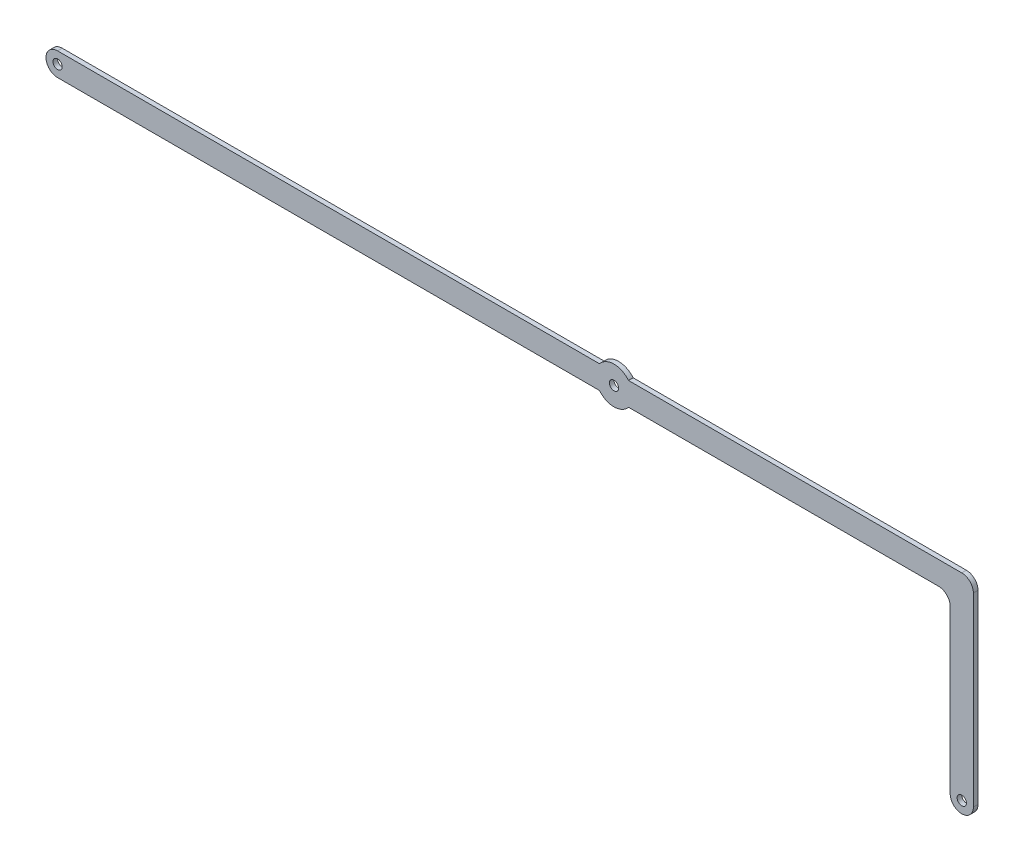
ISO-10303-21;
HEADER;
FILE_DESCRIPTION(('STEP AP214'),'2;1');
FILE_NAME('part.step','',(''),(''),'','','');
FILE_SCHEMA(('AUTOMOTIVE_DESIGN { 1 0 10303 214 1 1 1 1 }'));
ENDSEC;
DATA;
#1=APPLICATION_CONTEXT('core data for automotive mechanical design processes');
#2=APPLICATION_PROTOCOL_DEFINITION('international standard','automotive_design',2000,#1);
#3=PRODUCT_CONTEXT('',#1,'mechanical');
#4=PRODUCT('Part','Part','',(#3));
#5=PRODUCT_RELATED_PRODUCT_CATEGORY('part','',(#4));
#6=PRODUCT_DEFINITION_FORMATION('','',#4);
#7=PRODUCT_DEFINITION_CONTEXT('part definition',#1,'design');
#8=PRODUCT_DEFINITION('design','',#6,#7);
#9=PRODUCT_DEFINITION_SHAPE('','',#8);
#10=(LENGTH_UNIT() NAMED_UNIT(*) SI_UNIT(.MILLI.,.METRE.));
#11=(NAMED_UNIT(*) PLANE_ANGLE_UNIT() SI_UNIT($,.RADIAN.));
#12=(NAMED_UNIT(*) SI_UNIT($,.STERADIAN.) SOLID_ANGLE_UNIT());
#13=UNCERTAINTY_MEASURE_WITH_UNIT(LENGTH_MEASURE(1.E-05),#10,'distance_accuracy_value','');
#14=(GEOMETRIC_REPRESENTATION_CONTEXT(3) GLOBAL_UNCERTAINTY_ASSIGNED_CONTEXT((#13)) GLOBAL_UNIT_ASSIGNED_CONTEXT((#10,
#11,#12)) REPRESENTATION_CONTEXT('',''));
#15=CARTESIAN_POINT('',(0.,0.,0.));
#16=DIRECTION('',(0.,0.,1.));
#17=DIRECTION('',(1.,0.,0.));
#18=AXIS2_PLACEMENT_3D('',#15,#16,#17);
#19=CARTESIAN_POINT('',(120.,0.,1.));
#20=DIRECTION('',(0.,0.,1.));
#21=DIRECTION('',(1.,0.,0.));
#22=AXIS2_PLACEMENT_3D('',#19,#20,#21);
#23=PLANE('',#22);
#24=CARTESIAN_POINT('',(120.,0.,1.));
#25=DIRECTION('',(0.,0.,1.));
#26=DIRECTION('',(1.,0.,0.));
#27=AXIS2_PLACEMENT_3D('',#24,#25,#26);
#28=CIRCLE('',#27,0.999999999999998);
#29=CARTESIAN_POINT('',(121.,0.,1.));
#30=VERTEX_POINT('',#29);
#31=EDGE_CURVE('E300',#30,#30,#28,.T.);
#32=ORIENTED_EDGE('',*,*,#31,.F.);
#33=EDGE_LOOP('',(#32));
#34=FACE_BOUND('',#33,.T.);
#35=CARTESIAN_POINT('',(120.,0.,1.));
#36=DIRECTION('',(0.,0.,1.));
#37=DIRECTION('',(1.,0.,0.));
#38=AXIS2_PLACEMENT_3D('',#35,#36,#37);
#39=CIRCLE('',#38,4.00000000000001);
#40=CARTESIAN_POINT('',(123.122498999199,2.5,1.));
#41=VERTEX_POINT('',#40);
#42=CARTESIAN_POINT('',(116.877501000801,2.5,1.));
#43=VERTEX_POINT('',#42);
#44=EDGE_CURVE('E165',#41,#43,#39,.T.);
#45=ORIENTED_EDGE('',*,*,#44,.T.);
#46=DIRECTION('',(-1.,0.,0.));
#47=VECTOR('',#46,1.);
#48=CARTESIAN_POINT('',(0.,2.5,1.));
#49=LINE('',#48,#47);
#50=CARTESIAN_POINT('',(0.,2.5,1.));
#51=VERTEX_POINT('',#50);
#52=EDGE_CURVE('E134',#43,#51,#49,.T.);
#53=ORIENTED_EDGE('',*,*,#52,.T.);
#54=CARTESIAN_POINT('',(0.,0.,1.));
#55=DIRECTION('',(0.,0.,1.));
#56=DIRECTION('',(1.,0.,0.));
#57=AXIS2_PLACEMENT_3D('',#54,#55,#56);
#58=CIRCLE('',#57,2.5);
#59=CARTESIAN_POINT('',(0.,-2.5,1.));
#60=VERTEX_POINT('',#59);
#61=EDGE_CURVE('E168',#51,#60,#58,.T.);
#62=ORIENTED_EDGE('',*,*,#61,.T.);
#63=DIRECTION('',(1.,0.,0.));
#64=VECTOR('',#63,1.);
#65=CARTESIAN_POINT('',(0.,-2.5,1.));
#66=LINE('',#65,#64);
#67=CARTESIAN_POINT('',(116.877501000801,-2.5,1.));
#68=VERTEX_POINT('',#67);
#69=EDGE_CURVE('E170',#60,#68,#66,.T.);
#70=ORIENTED_EDGE('',*,*,#69,.T.);
#71=CARTESIAN_POINT('',(120.,0.,1.));
#72=DIRECTION('',(0.,0.,1.));
#73=DIRECTION('',(1.,0.,0.));
#74=AXIS2_PLACEMENT_3D('',#71,#72,#73);
#75=CIRCLE('',#74,4.);
#76=CARTESIAN_POINT('',(123.122498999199,-2.5,1.));
#77=VERTEX_POINT('',#76);
#78=EDGE_CURVE('E172',#68,#77,#75,.T.);
#79=ORIENTED_EDGE('',*,*,#78,.T.);
#80=DIRECTION('',(1.,0.,0.));
#81=VECTOR('',#80,1.);
#82=CARTESIAN_POINT('',(123.122498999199,-2.5,1.));
#83=LINE('',#82,#81);
#84=CARTESIAN_POINT('',(190.,-2.5,1.));
#85=VERTEX_POINT('',#84);
#86=EDGE_CURVE('E174',#77,#85,#83,.T.);
#87=ORIENTED_EDGE('',*,*,#86,.T.);
#88=CARTESIAN_POINT('',(190.,-5.,1.));
#89=DIRECTION('',(0.,0.,-1.));
#90=DIRECTION('',(1.,0.,0.));
#91=AXIS2_PLACEMENT_3D('',#88,#89,#90);
#92=CIRCLE('',#91,2.5);
#93=CARTESIAN_POINT('',(192.5,-5.00000000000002,1.));
#94=VERTEX_POINT('',#93);
#95=EDGE_CURVE('E176',#85,#94,#92,.T.);
#96=ORIENTED_EDGE('',*,*,#95,.T.);
#97=DIRECTION('',(0.,-1.,0.));
#98=VECTOR('',#97,1.);
#99=CARTESIAN_POINT('',(192.5,-5.00000000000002,1.));
#100=LINE('',#99,#98);
#101=CARTESIAN_POINT('',(192.5,-40.,1.));
#102=VERTEX_POINT('',#101);
#103=EDGE_CURVE('E178',#94,#102,#100,.T.);
#104=ORIENTED_EDGE('',*,*,#103,.T.);
#105=CARTESIAN_POINT('',(195.,-40.,1.));
#106=DIRECTION('',(0.,0.,1.));
#107=DIRECTION('',(1.,0.,0.));
#108=AXIS2_PLACEMENT_3D('',#105,#106,#107);
#109=CIRCLE('',#108,2.5);
#110=CARTESIAN_POINT('',(197.5,-40.,1.));
#111=VERTEX_POINT('',#110);
#112=EDGE_CURVE('E180',#102,#111,#109,.T.);
#113=ORIENTED_EDGE('',*,*,#112,.T.);
#114=DIRECTION('',(0.,1.,0.));
#115=VECTOR('',#114,1.);
#116=CARTESIAN_POINT('',(197.5,0.,1.));
#117=LINE('',#116,#115);
#118=CARTESIAN_POINT('',(197.5,0.,1.));
#119=VERTEX_POINT('',#118);
#120=EDGE_CURVE('E182',#111,#119,#117,.T.);
#121=ORIENTED_EDGE('',*,*,#120,.T.);
#122=CARTESIAN_POINT('',(195.,0.,1.));
#123=DIRECTION('',(0.,0.,1.));
#124=DIRECTION('',(1.,0.,0.));
#125=AXIS2_PLACEMENT_3D('',#122,#123,#124);
#126=CIRCLE('',#125,2.5);
#127=CARTESIAN_POINT('',(195.,2.5,1.));
#128=VERTEX_POINT('',#127);
#129=EDGE_CURVE('E51',#119,#128,#126,.T.);
#130=ORIENTED_EDGE('',*,*,#129,.T.);
#131=DIRECTION('',(-1.,0.,0.));
#132=VECTOR('',#131,1.);
#133=CARTESIAN_POINT('',(123.122498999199,2.5,1.));
#134=LINE('',#133,#132);
#135=EDGE_CURVE('E46',#128,#41,#134,.T.);
#136=ORIENTED_EDGE('',*,*,#135,.T.);
#137=EDGE_LOOP('',(#45,#53,#62,#70,#79,#87,#96,#104,#113,#121,#130,#136));
#138=FACE_BOUND('',#137,.T.);
#139=CARTESIAN_POINT('',(0.,0.,1.));
#140=DIRECTION('',(0.,0.,1.));
#141=DIRECTION('',(1.,0.,0.));
#142=AXIS2_PLACEMENT_3D('',#139,#140,#141);
#143=CIRCLE('',#142,0.999999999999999);
#144=CARTESIAN_POINT('',(0.999999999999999,0.,1.));
#145=VERTEX_POINT('',#144);
#146=EDGE_CURVE('E139',#145,#145,#143,.T.);
#147=ORIENTED_EDGE('',*,*,#146,.F.);
#148=EDGE_LOOP('',(#147));
#149=FACE_BOUND('',#148,.T.);
#150=CARTESIAN_POINT('',(195.,-40.,1.));
#151=DIRECTION('',(0.,0.,1.));
#152=DIRECTION('',(1.,0.,0.));
#153=AXIS2_PLACEMENT_3D('',#150,#151,#152);
#154=CIRCLE('',#153,0.999999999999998);
#155=CARTESIAN_POINT('',(196.,-40.,1.));
#156=VERTEX_POINT('',#155);
#157=EDGE_CURVE('E289',#156,#156,#154,.T.);
#158=ORIENTED_EDGE('',*,*,#157,.F.);
#159=EDGE_LOOP('',(#158));
#160=FACE_BOUND('',#159,.T.);
#161=ADVANCED_FACE('F31',(#34,#138,#149,#160),#23,.T.);
#162=CARTESIAN_POINT('',(120.,0.,0.));
#163=DIRECTION('',(0.,0.,1.));
#164=DIRECTION('',(1.,0.,0.));
#165=AXIS2_PLACEMENT_3D('',#162,#163,#164);
#166=PLANE('',#165);
#167=CARTESIAN_POINT('',(120.,0.,0.));
#168=DIRECTION('',(0.,0.,1.));
#169=DIRECTION('',(1.,0.,0.));
#170=AXIS2_PLACEMENT_3D('',#167,#168,#169);
#171=CIRCLE('',#170,0.999999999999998);
#172=CARTESIAN_POINT('',(121.,0.,0.));
#173=VERTEX_POINT('',#172);
#174=EDGE_CURVE('E295',#173,#173,#171,.T.);
#175=ORIENTED_EDGE('',*,*,#174,.T.);
#176=EDGE_LOOP('',(#175));
#177=FACE_BOUND('',#176,.T.);
#178=CARTESIAN_POINT('',(120.,0.,0.));
#179=DIRECTION('',(0.,0.,1.));
#180=DIRECTION('',(1.,0.,0.));
#181=AXIS2_PLACEMENT_3D('',#178,#179,#180);
#182=CIRCLE('',#181,4.00000000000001);
#183=CARTESIAN_POINT('',(123.122498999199,2.5,0.));
#184=VERTEX_POINT('',#183);
#185=CARTESIAN_POINT('',(116.877501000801,2.5,0.));
#186=VERTEX_POINT('',#185);
#187=EDGE_CURVE('E125',#184,#186,#182,.T.);
#188=ORIENTED_EDGE('',*,*,#187,.F.);
#189=DIRECTION('',(-1.,0.,0.));
#190=VECTOR('',#189,1.);
#191=CARTESIAN_POINT('',(123.122498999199,2.5,0.));
#192=LINE('',#191,#190);
#193=CARTESIAN_POINT('',(195.,2.5,0.));
#194=VERTEX_POINT('',#193);
#195=EDGE_CURVE('E163',#194,#184,#192,.T.);
#196=ORIENTED_EDGE('',*,*,#195,.F.);
#197=CARTESIAN_POINT('',(195.,0.,0.));
#198=DIRECTION('',(0.,0.,1.));
#199=DIRECTION('',(1.,0.,0.));
#200=AXIS2_PLACEMENT_3D('',#197,#198,#199);
#201=CIRCLE('',#200,2.5);
#202=CARTESIAN_POINT('',(197.5,0.,0.));
#203=VERTEX_POINT('',#202);
#204=EDGE_CURVE('E161',#203,#194,#201,.T.);
#205=ORIENTED_EDGE('',*,*,#204,.F.);
#206=DIRECTION('',(0.,1.,0.));
#207=VECTOR('',#206,1.);
#208=CARTESIAN_POINT('',(197.5,0.,0.));
#209=LINE('',#208,#207);
#210=CARTESIAN_POINT('',(197.5,-40.,0.));
#211=VERTEX_POINT('',#210);
#212=EDGE_CURVE('E159',#211,#203,#209,.T.);
#213=ORIENTED_EDGE('',*,*,#212,.F.);
#214=CARTESIAN_POINT('',(195.,-40.,0.));
#215=DIRECTION('',(0.,0.,1.));
#216=DIRECTION('',(1.,0.,0.));
#217=AXIS2_PLACEMENT_3D('',#214,#215,#216);
#218=CIRCLE('',#217,2.5);
#219=CARTESIAN_POINT('',(192.5,-40.,0.));
#220=VERTEX_POINT('',#219);
#221=EDGE_CURVE('E157',#220,#211,#218,.T.);
#222=ORIENTED_EDGE('',*,*,#221,.F.);
#223=DIRECTION('',(0.,-1.,0.));
#224=VECTOR('',#223,1.);
#225=CARTESIAN_POINT('',(192.5,-5.00000000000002,0.));
#226=LINE('',#225,#224);
#227=CARTESIAN_POINT('',(192.5,-5.00000000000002,0.));
#228=VERTEX_POINT('',#227);
#229=EDGE_CURVE('E155',#228,#220,#226,.T.);
#230=ORIENTED_EDGE('',*,*,#229,.F.);
#231=CARTESIAN_POINT('',(190.,-5.,0.));
#232=DIRECTION('',(0.,0.,-1.));
#233=DIRECTION('',(1.,0.,0.));
#234=AXIS2_PLACEMENT_3D('',#231,#232,#233);
#235=CIRCLE('',#234,2.5);
#236=CARTESIAN_POINT('',(190.,-2.5,0.));
#237=VERTEX_POINT('',#236);
#238=EDGE_CURVE('E153',#237,#228,#235,.T.);
#239=ORIENTED_EDGE('',*,*,#238,.F.);
#240=DIRECTION('',(1.,0.,0.));
#241=VECTOR('',#240,1.);
#242=CARTESIAN_POINT('',(123.122498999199,-2.5,0.));
#243=LINE('',#242,#241);
#244=CARTESIAN_POINT('',(123.122498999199,-2.5,0.));
#245=VERTEX_POINT('',#244);
#246=EDGE_CURVE('E151',#245,#237,#243,.T.);
#247=ORIENTED_EDGE('',*,*,#246,.F.);
#248=CARTESIAN_POINT('',(120.,0.,0.));
#249=DIRECTION('',(0.,0.,1.));
#250=DIRECTION('',(1.,0.,0.));
#251=AXIS2_PLACEMENT_3D('',#248,#249,#250);
#252=CIRCLE('',#251,4.);
#253=CARTESIAN_POINT('',(116.877501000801,-2.5,0.));
#254=VERTEX_POINT('',#253);
#255=EDGE_CURVE('E149',#254,#245,#252,.T.);
#256=ORIENTED_EDGE('',*,*,#255,.F.);
#257=DIRECTION('',(1.,0.,0.));
#258=VECTOR('',#257,1.);
#259=CARTESIAN_POINT('',(0.,-2.5,0.));
#260=LINE('',#259,#258);
#261=CARTESIAN_POINT('',(0.,-2.5,0.));
#262=VERTEX_POINT('',#261);
#263=EDGE_CURVE('E147',#262,#254,#260,.T.);
#264=ORIENTED_EDGE('',*,*,#263,.F.);
#265=CARTESIAN_POINT('',(0.,0.,0.));
#266=DIRECTION('',(0.,0.,1.));
#267=DIRECTION('',(1.,0.,0.));
#268=AXIS2_PLACEMENT_3D('',#265,#266,#267);
#269=CIRCLE('',#268,2.5);
#270=CARTESIAN_POINT('',(0.,2.5,0.));
#271=VERTEX_POINT('',#270);
#272=EDGE_CURVE('E127',#271,#262,#269,.T.);
#273=ORIENTED_EDGE('',*,*,#272,.F.);
#274=DIRECTION('',(-1.,0.,0.));
#275=VECTOR('',#274,1.);
#276=CARTESIAN_POINT('',(0.,2.5,0.));
#277=LINE('',#276,#275);
#278=EDGE_CURVE('E120',#186,#271,#277,.T.);
#279=ORIENTED_EDGE('',*,*,#278,.F.);
#280=EDGE_LOOP('',(#188,#196,#205,#213,#222,#230,#239,#247,#256,#264,#273,#279));
#281=FACE_BOUND('',#280,.T.);
#282=CARTESIAN_POINT('',(0.,0.,0.));
#283=DIRECTION('',(0.,0.,1.));
#284=DIRECTION('',(1.,0.,0.));
#285=AXIS2_PLACEMENT_3D('',#282,#283,#284);
#286=CIRCLE('',#285,0.999999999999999);
#287=CARTESIAN_POINT('',(0.999999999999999,0.,0.));
#288=VERTEX_POINT('',#287);
#289=EDGE_CURVE('E142',#288,#288,#286,.T.);
#290=ORIENTED_EDGE('',*,*,#289,.T.);
#291=EDGE_LOOP('',(#290));
#292=FACE_BOUND('',#291,.T.);
#293=CARTESIAN_POINT('',(195.,-40.,0.));
#294=DIRECTION('',(0.,0.,1.));
#295=DIRECTION('',(1.,0.,0.));
#296=AXIS2_PLACEMENT_3D('',#293,#294,#295);
#297=CIRCLE('',#296,0.999999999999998);
#298=CARTESIAN_POINT('',(196.,-40.,0.));
#299=VERTEX_POINT('',#298);
#300=EDGE_CURVE('E292',#299,#299,#297,.T.);
#301=ORIENTED_EDGE('',*,*,#300,.T.);
#302=EDGE_LOOP('',(#301));
#303=FACE_BOUND('',#302,.T.);
#304=ADVANCED_FACE('F121',(#177,#281,#292,#303),#166,.F.);
#305=CARTESIAN_POINT('',(120.,0.,1.));
#306=DIRECTION('',(0.,0.,-1.));
#307=DIRECTION('',(-1.,0.,0.));
#308=AXIS2_PLACEMENT_3D('',#305,#306,#307);
#309=CYLINDRICAL_SURFACE('',#308,4.00000000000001);
#310=ORIENTED_EDGE('',*,*,#187,.T.);
#311=DIRECTION('',(0.,0.,-1.));
#312=VECTOR('',#311,1.);
#313=CARTESIAN_POINT('',(116.877501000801,2.5,1.));
#314=LINE('',#313,#312);
#315=EDGE_CURVE('E11',#43,#186,#314,.T.);
#316=ORIENTED_EDGE('',*,*,#315,.F.);
#317=ORIENTED_EDGE('',*,*,#44,.F.);
#318=DIRECTION('',(0.,0.,-1.));
#319=VECTOR('',#318,1.);
#320=CARTESIAN_POINT('',(123.122498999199,2.5,1.));
#321=LINE('',#320,#319);
#322=EDGE_CURVE('E138',#41,#184,#321,.T.);
#323=ORIENTED_EDGE('',*,*,#322,.T.);
#324=EDGE_LOOP('',(#310,#316,#317,#323));
#325=FACE_BOUND('',#324,.T.);
#326=ADVANCED_FACE('F33',(#325),#309,.T.);
#327=CARTESIAN_POINT('',(0.,2.5,1.));
#328=DIRECTION('',(0.,-1.,0.));
#329=DIRECTION('',(0.,0.,-1.));
#330=AXIS2_PLACEMENT_3D('',#327,#328,#329);
#331=PLANE('',#330);
#332=ORIENTED_EDGE('',*,*,#278,.T.);
#333=DIRECTION('',(0.,0.,-1.));
#334=VECTOR('',#333,1.);
#335=CARTESIAN_POINT('',(0.,2.5,1.));
#336=LINE('',#335,#334);
#337=EDGE_CURVE('E39',#51,#271,#336,.T.);
#338=ORIENTED_EDGE('',*,*,#337,.F.);
#339=ORIENTED_EDGE('',*,*,#52,.F.);
#340=ORIENTED_EDGE('',*,*,#315,.T.);
#341=EDGE_LOOP('',(#332,#338,#339,#340));
#342=FACE_BOUND('',#341,.T.);
#343=ADVANCED_FACE('F133',(#342),#331,.F.);
#344=CARTESIAN_POINT('',(0.,0.,1.));
#345=DIRECTION('',(0.,0.,-1.));
#346=DIRECTION('',(-1.,0.,0.));
#347=AXIS2_PLACEMENT_3D('',#344,#345,#346);
#348=CYLINDRICAL_SURFACE('',#347,2.5);
#349=ORIENTED_EDGE('',*,*,#272,.T.);
#350=DIRECTION('',(0.,0.,-1.));
#351=VECTOR('',#350,1.);
#352=CARTESIAN_POINT('',(0.,-2.5,1.));
#353=LINE('',#352,#351);
#354=EDGE_CURVE('E211',#60,#262,#353,.T.);
#355=ORIENTED_EDGE('',*,*,#354,.F.);
#356=ORIENTED_EDGE('',*,*,#61,.F.);
#357=ORIENTED_EDGE('',*,*,#337,.T.);
#358=EDGE_LOOP('',(#349,#355,#356,#357));
#359=FACE_BOUND('',#358,.T.);
#360=ADVANCED_FACE('F215',(#359),#348,.T.);
#361=CARTESIAN_POINT('',(0.,-2.5,1.));
#362=DIRECTION('',(0.,1.,0.));
#363=DIRECTION('',(0.,0.,1.));
#364=AXIS2_PLACEMENT_3D('',#361,#362,#363);
#365=PLANE('',#364);
#366=ORIENTED_EDGE('',*,*,#263,.T.);
#367=DIRECTION('',(0.,0.,-1.));
#368=VECTOR('',#367,1.);
#369=CARTESIAN_POINT('',(116.877501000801,-2.5,1.));
#370=LINE('',#369,#368);
#371=EDGE_CURVE('E208',#68,#254,#370,.T.);
#372=ORIENTED_EDGE('',*,*,#371,.F.);
#373=ORIENTED_EDGE('',*,*,#69,.F.);
#374=ORIENTED_EDGE('',*,*,#354,.T.);
#375=EDGE_LOOP('',(#366,#372,#373,#374));
#376=FACE_BOUND('',#375,.T.);
#377=ADVANCED_FACE('F223',(#376),#365,.F.);
#378=CARTESIAN_POINT('',(120.,0.,1.));
#379=DIRECTION('',(0.,0.,-1.));
#380=DIRECTION('',(-1.,0.,0.));
#381=AXIS2_PLACEMENT_3D('',#378,#379,#380);
#382=CYLINDRICAL_SURFACE('',#381,4.);
#383=ORIENTED_EDGE('',*,*,#255,.T.);
#384=DIRECTION('',(0.,0.,-1.));
#385=VECTOR('',#384,1.);
#386=CARTESIAN_POINT('',(123.122498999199,-2.5,1.));
#387=LINE('',#386,#385);
#388=EDGE_CURVE('E205',#77,#245,#387,.T.);
#389=ORIENTED_EDGE('',*,*,#388,.F.);
#390=ORIENTED_EDGE('',*,*,#78,.F.);
#391=ORIENTED_EDGE('',*,*,#371,.T.);
#392=EDGE_LOOP('',(#383,#389,#390,#391));
#393=FACE_BOUND('',#392,.T.);
#394=ADVANCED_FACE('F226',(#393),#382,.T.);
#395=CARTESIAN_POINT('',(123.122498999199,-2.5,1.));
#396=DIRECTION('',(0.,1.,0.));
#397=DIRECTION('',(0.,0.,1.));
#398=AXIS2_PLACEMENT_3D('',#395,#396,#397);
#399=PLANE('',#398);
#400=ORIENTED_EDGE('',*,*,#246,.T.);
#401=DIRECTION('',(0.,0.,-1.));
#402=VECTOR('',#401,1.);
#403=CARTESIAN_POINT('',(190.,-2.5,1.));
#404=LINE('',#403,#402);
#405=EDGE_CURVE('E202',#85,#237,#404,.T.);
#406=ORIENTED_EDGE('',*,*,#405,.F.);
#407=ORIENTED_EDGE('',*,*,#86,.F.);
#408=ORIENTED_EDGE('',*,*,#388,.T.);
#409=EDGE_LOOP('',(#400,#406,#407,#408));
#410=FACE_BOUND('',#409,.T.);
#411=ADVANCED_FACE('F231',(#410),#399,.F.);
#412=CARTESIAN_POINT('',(190.,-5.,1.));
#413=DIRECTION('',(0.,0.,-1.));
#414=DIRECTION('',(-1.,0.,0.));
#415=AXIS2_PLACEMENT_3D('',#412,#413,#414);
#416=CYLINDRICAL_SURFACE('',#415,2.5);
#417=ORIENTED_EDGE('',*,*,#238,.T.);
#418=DIRECTION('',(0.,0.,-1.));
#419=VECTOR('',#418,1.);
#420=CARTESIAN_POINT('',(192.5,-5.00000000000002,1.));
#421=LINE('',#420,#419);
#422=EDGE_CURVE('E199',#94,#228,#421,.T.);
#423=ORIENTED_EDGE('',*,*,#422,.F.);
#424=ORIENTED_EDGE('',*,*,#95,.F.);
#425=ORIENTED_EDGE('',*,*,#405,.T.);
#426=EDGE_LOOP('',(#417,#423,#424,#425));
#427=FACE_BOUND('',#426,.T.);
#428=ADVANCED_FACE('F237',(#427),#416,.F.);
#429=CARTESIAN_POINT('',(192.5,-5.00000000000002,1.));
#430=DIRECTION('',(1.,0.,0.));
#431=DIRECTION('',(0.,0.,-1.));
#432=AXIS2_PLACEMENT_3D('',#429,#430,#431);
#433=PLANE('',#432);
#434=ORIENTED_EDGE('',*,*,#229,.T.);
#435=DIRECTION('',(0.,0.,-1.));
#436=VECTOR('',#435,1.);
#437=CARTESIAN_POINT('',(192.5,-40.,1.));
#438=LINE('',#437,#436);
#439=EDGE_CURVE('E196',#102,#220,#438,.T.);
#440=ORIENTED_EDGE('',*,*,#439,.F.);
#441=ORIENTED_EDGE('',*,*,#103,.F.);
#442=ORIENTED_EDGE('',*,*,#422,.T.);
#443=EDGE_LOOP('',(#434,#440,#441,#442));
#444=FACE_BOUND('',#443,.T.);
#445=ADVANCED_FACE('F241',(#444),#433,.F.);
#446=CARTESIAN_POINT('',(195.,-40.,1.));
#447=DIRECTION('',(0.,0.,-1.));
#448=DIRECTION('',(-1.,0.,0.));
#449=AXIS2_PLACEMENT_3D('',#446,#447,#448);
#450=CYLINDRICAL_SURFACE('',#449,2.5);
#451=ORIENTED_EDGE('',*,*,#221,.T.);
#452=DIRECTION('',(0.,0.,-1.));
#453=VECTOR('',#452,1.);
#454=CARTESIAN_POINT('',(197.5,-40.,1.));
#455=LINE('',#454,#453);
#456=EDGE_CURVE('E193',#111,#211,#455,.T.);
#457=ORIENTED_EDGE('',*,*,#456,.F.);
#458=ORIENTED_EDGE('',*,*,#112,.F.);
#459=ORIENTED_EDGE('',*,*,#439,.T.);
#460=EDGE_LOOP('',(#451,#457,#458,#459));
#461=FACE_BOUND('',#460,.T.);
#462=ADVANCED_FACE('F246',(#461),#450,.T.);
#463=CARTESIAN_POINT('',(197.5,0.,1.));
#464=DIRECTION('',(-1.,0.,0.));
#465=DIRECTION('',(0.,0.,1.));
#466=AXIS2_PLACEMENT_3D('',#463,#464,#465);
#467=PLANE('',#466);
#468=ORIENTED_EDGE('',*,*,#212,.T.);
#469=DIRECTION('',(0.,0.,-1.));
#470=VECTOR('',#469,1.);
#471=CARTESIAN_POINT('',(197.5,0.,1.));
#472=LINE('',#471,#470);
#473=EDGE_CURVE('E190',#119,#203,#472,.T.);
#474=ORIENTED_EDGE('',*,*,#473,.F.);
#475=ORIENTED_EDGE('',*,*,#120,.F.);
#476=ORIENTED_EDGE('',*,*,#456,.T.);
#477=EDGE_LOOP('',(#468,#474,#475,#476));
#478=FACE_BOUND('',#477,.T.);
#479=ADVANCED_FACE('F250',(#478),#467,.F.);
#480=CARTESIAN_POINT('',(195.,0.,1.));
#481=DIRECTION('',(0.,0.,-1.));
#482=DIRECTION('',(-1.,0.,0.));
#483=AXIS2_PLACEMENT_3D('',#480,#481,#482);
#484=CYLINDRICAL_SURFACE('',#483,2.5);
#485=ORIENTED_EDGE('',*,*,#204,.T.);
#486=DIRECTION('',(0.,0.,-1.));
#487=VECTOR('',#486,1.);
#488=CARTESIAN_POINT('',(195.,2.5,1.));
#489=LINE('',#488,#487);
#490=EDGE_CURVE('E187',#128,#194,#489,.T.);
#491=ORIENTED_EDGE('',*,*,#490,.F.);
#492=ORIENTED_EDGE('',*,*,#129,.F.);
#493=ORIENTED_EDGE('',*,*,#473,.T.);
#494=EDGE_LOOP('',(#485,#491,#492,#493));
#495=FACE_BOUND('',#494,.T.);
#496=ADVANCED_FACE('F254',(#495),#484,.T.);
#497=CARTESIAN_POINT('',(123.122498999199,2.5,1.));
#498=DIRECTION('',(0.,-1.,0.));
#499=DIRECTION('',(0.,0.,-1.));
#500=AXIS2_PLACEMENT_3D('',#497,#498,#499);
#501=PLANE('',#500);
#502=ORIENTED_EDGE('',*,*,#195,.T.);
#503=ORIENTED_EDGE('',*,*,#322,.F.);
#504=ORIENTED_EDGE('',*,*,#135,.F.);
#505=ORIENTED_EDGE('',*,*,#490,.T.);
#506=EDGE_LOOP('',(#502,#503,#504,#505));
#507=FACE_BOUND('',#506,.T.);
#508=ADVANCED_FACE('F256',(#507),#501,.F.);
#509=CARTESIAN_POINT('',(0.,0.,1.));
#510=DIRECTION('',(0.,0.,-1.));
#511=DIRECTION('',(-1.,0.,0.));
#512=AXIS2_PLACEMENT_3D('',#509,#510,#511);
#513=CYLINDRICAL_SURFACE('',#512,0.999999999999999);
#514=ORIENTED_EDGE('',*,*,#146,.T.);
#515=EDGE_LOOP('',(#514));
#516=FACE_BOUND('',#515,.T.);
#517=ORIENTED_EDGE('',*,*,#289,.F.);
#518=EDGE_LOOP('',(#517));
#519=FACE_BOUND('',#518,.T.);
#520=ADVANCED_FACE('F258',(#516,#519),#513,.F.);
#521=CARTESIAN_POINT('',(120.,0.,1.));
#522=DIRECTION('',(0.,0.,-1.));
#523=DIRECTION('',(-1.,0.,0.));
#524=AXIS2_PLACEMENT_3D('',#521,#522,#523);
#525=CYLINDRICAL_SURFACE('',#524,0.999999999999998);
#526=ORIENTED_EDGE('',*,*,#31,.T.);
#527=EDGE_LOOP('',(#526));
#528=FACE_BOUND('',#527,.T.);
#529=ORIENTED_EDGE('',*,*,#174,.F.);
#530=EDGE_LOOP('',(#529));
#531=FACE_BOUND('',#530,.T.);
#532=ADVANCED_FACE('F264',(#528,#531),#525,.F.);
#533=CARTESIAN_POINT('',(195.,-40.,1.));
#534=DIRECTION('',(0.,0.,-1.));
#535=DIRECTION('',(-1.,0.,0.));
#536=AXIS2_PLACEMENT_3D('',#533,#534,#535);
#537=CYLINDRICAL_SURFACE('',#536,0.999999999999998);
#538=ORIENTED_EDGE('',*,*,#157,.T.);
#539=EDGE_LOOP('',(#538));
#540=FACE_BOUND('',#539,.T.);
#541=ORIENTED_EDGE('',*,*,#300,.F.);
#542=EDGE_LOOP('',(#541));
#543=FACE_BOUND('',#542,.T.);
#544=ADVANCED_FACE('F280',(#540,#543),#537,.F.);
#545=CLOSED_SHELL('',(#161,#304,#326,#343,#360,#377,#394,#411,#428,#445,#462,#479,#496,#508,
#520,#532,#544));
#546=MANIFOLD_SOLID_BREP('B2',#545);
#547=ADVANCED_BREP_SHAPE_REPRESENTATION('',(#18,#546),#14);
#548=SHAPE_DEFINITION_REPRESENTATION(#9,#547);
ENDSEC;
END-ISO-10303-21;
